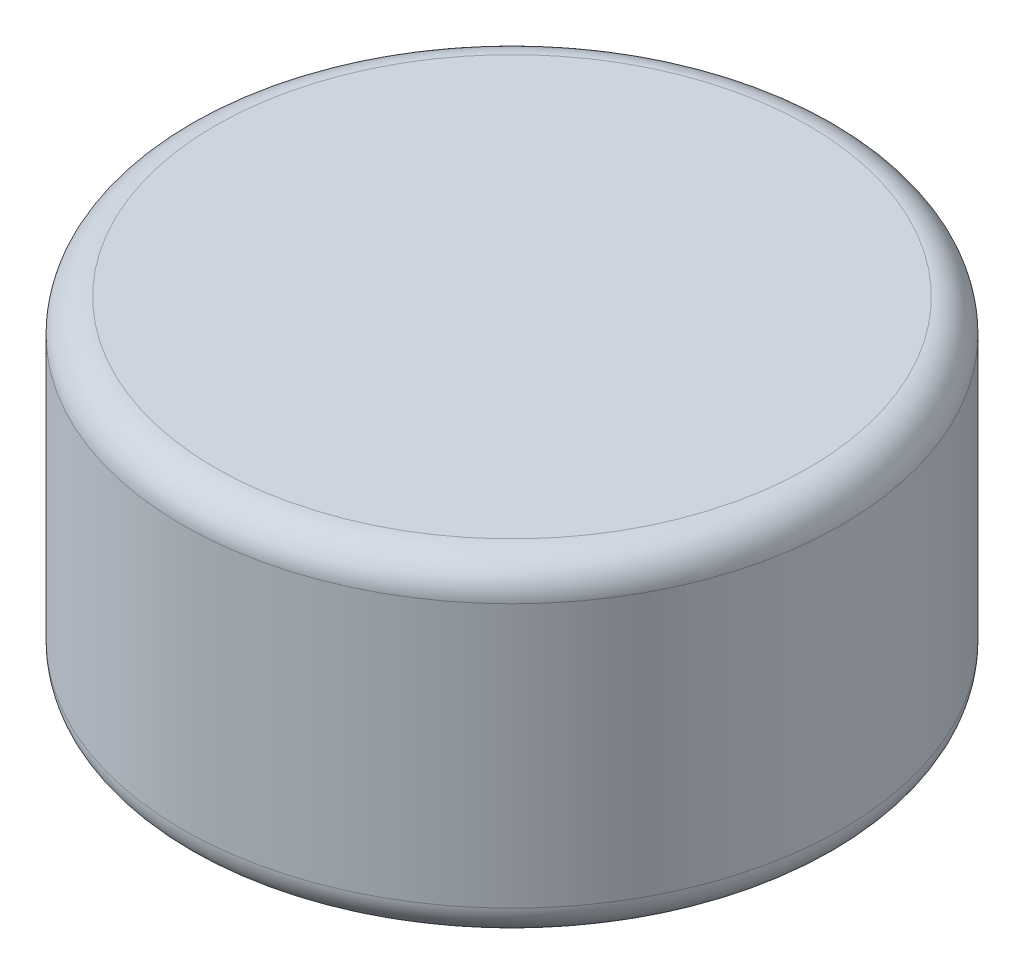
from build123d import *

# Parameters (mm, degrees)
SKETCH1_R           = 1.5875
BOSS_EXTRUDE1_DEPTH = 0.79375
FILLET1_R           = 0.15875


with BuildPart() as part:
    # Sketch1 → Boss-Extrude1 (new, symmetric)
    with BuildSketch(Plane(origin=(0, 0, 0), x_dir=(1, 0, 0), z_dir=(0, 1, 0))):
        with Locations(Location((0, 0, 0), (0, 0, 270))):
            Circle(SKETCH1_R)
    extrude(amount=BOSS_EXTRUDE1_DEPTH, both=True)

    # Fillet1
    fillet1_edges = [part.edges().sort_by_distance(p)[0] for p in [
        (0, -0.79375, -1.5875),
        (0, 0.79375, -1.5875),
    ]]
    fillet(fillet1_edges, radius=FILLET1_R)


solid = part.part
